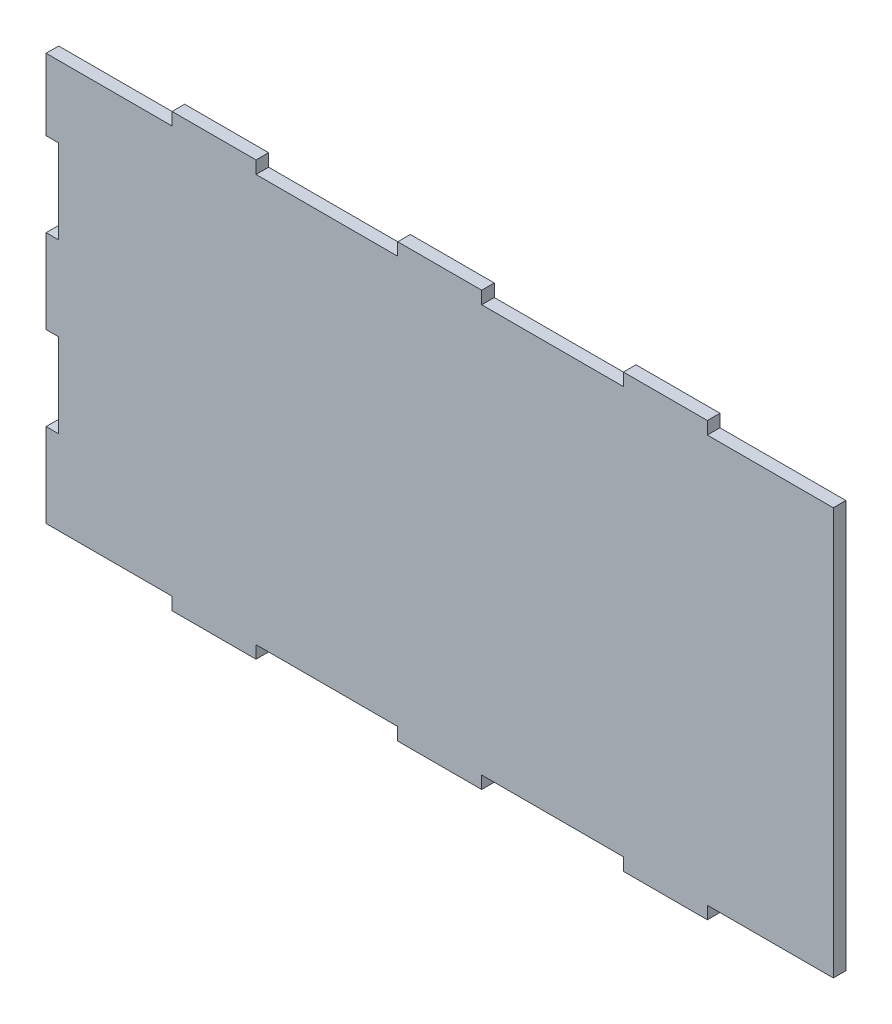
from build123d import *

# Parameters (mm, degrees)
SALIENTE_EXTRUIR1_DEPTH = 12


with BuildPart() as part:
    # Croquis1 → Saliente-Extruir1 (new body)
    with BuildSketch(Plane.XY):
        Polygon((-175, -206), (-255, -206), (-255, -194), (-375, -194), (-375, -114), (-363, -114), (-363, -34), (-375, -34), (-375, 46), (-363, 46), (-363, 126), (-375, 126), (-375, 194), (-255, 194), (-255, 206), (-175, 206), (-175, 194), (-40, 194), (-40, 206), (40, 206), (40, 194), (175, 194), (175, 206), (255, 206), (255, 194), (375, 194), (375, -194), (255, -194), (255, -206), (175, -206), (175, -194), (40, -194), (40, -206), (-40, -206), (-40, -194), (-175, -194), align=None)
    extrude(amount=SALIENTE_EXTRUIR1_DEPTH)


solid = part.part
